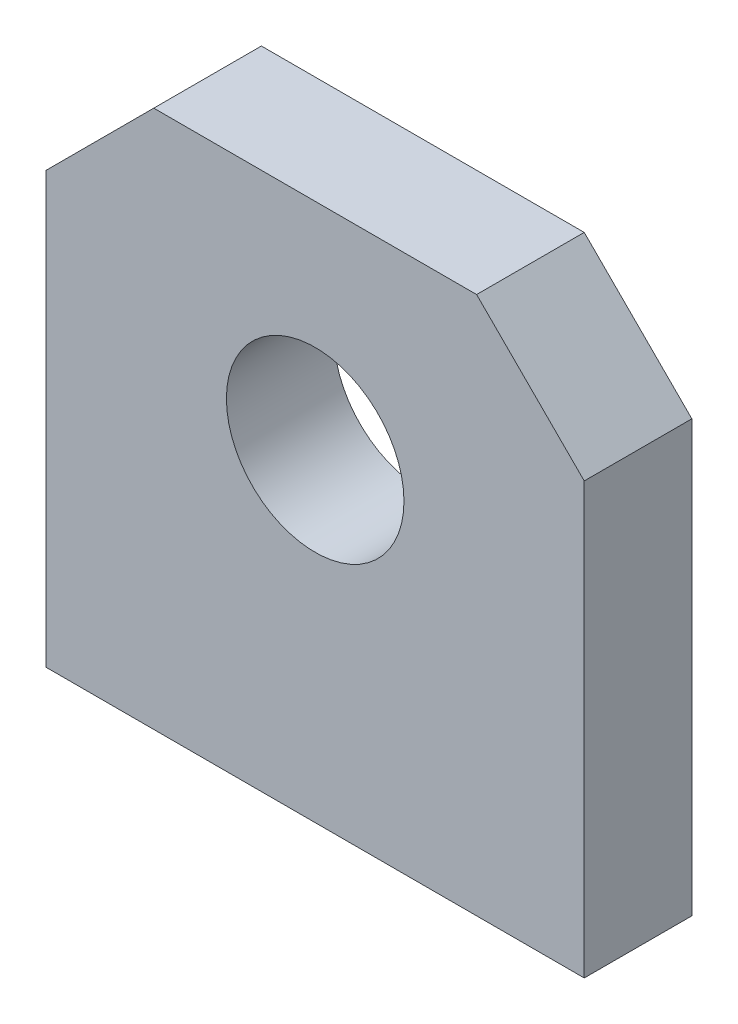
from build123d import *

# Parameters (mm, degrees)
ESQUISSE1_W        = 50
ESQUISSE1_H        = 50
ESQUISSE1_R        = 8.25
BOSS_EXTRU_1_DEPTH = 10
CHANFREIN1_SIZE    = 10


with BuildPart() as part:
    # Esquisse1 → Boss.-Extru.1 (new body)
    with BuildSketch(Plane.XY):
        with Locations((25, 25)):
            Rectangle(ESQUISSE1_W, ESQUISSE1_H)
        with Locations((25, 30)):
            Circle(ESQUISSE1_R, mode=Mode.SUBTRACT)
    extrude(amount=BOSS_EXTRU_1_DEPTH)

    # Chanfrein1
    chanfrein1_edges = [part.edges().sort_by_distance(p)[0] for p in [
        (0, 50, 5),
        (50, 50, 5),
    ]]
    chamfer(chanfrein1_edges, length=CHANFREIN1_SIZE)


solid = part.part
